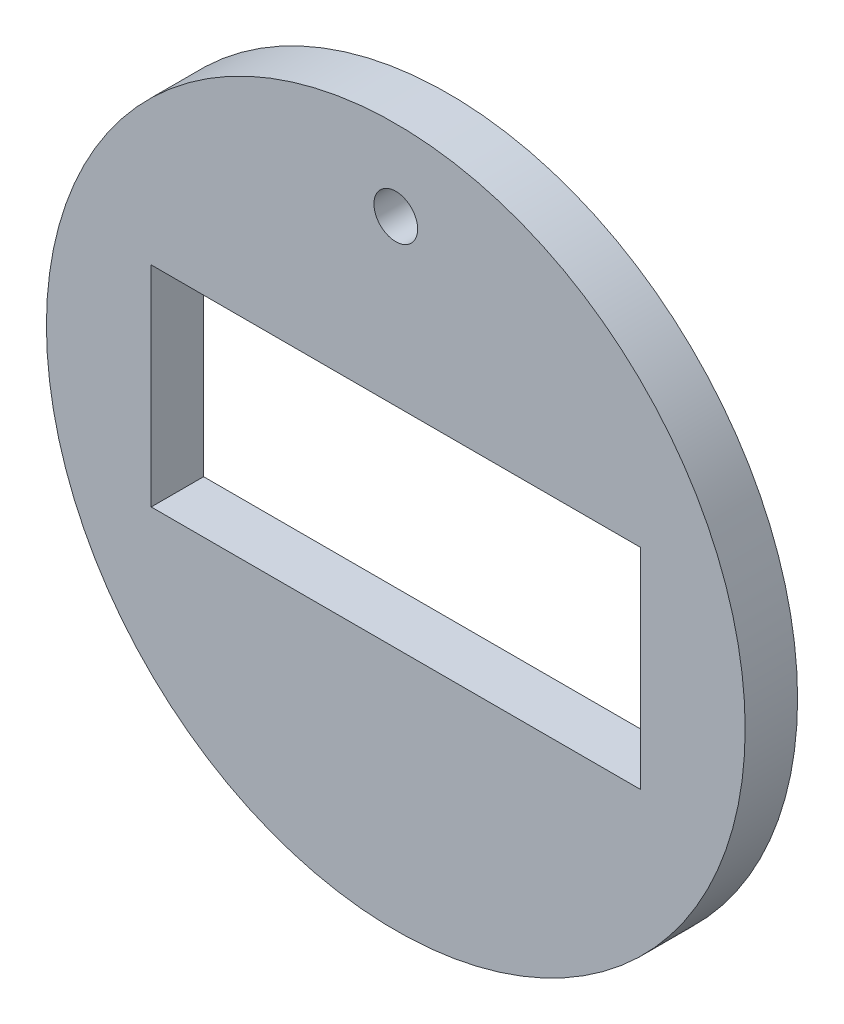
ISO-10303-21;
HEADER;
FILE_DESCRIPTION(('STEP AP214'),'2;1');
FILE_NAME('part.step','',(''),(''),'','','');
FILE_SCHEMA(('AUTOMOTIVE_DESIGN { 1 0 10303 214 1 1 1 1 }'));
ENDSEC;
DATA;
#1=APPLICATION_CONTEXT('core data for automotive mechanical design processes');
#2=APPLICATION_PROTOCOL_DEFINITION('international standard','automotive_design',2000,#1);
#3=PRODUCT_CONTEXT('',#1,'mechanical');
#4=PRODUCT('Part','Part','',(#3));
#5=PRODUCT_RELATED_PRODUCT_CATEGORY('part','',(#4));
#6=PRODUCT_DEFINITION_FORMATION('','',#4);
#7=PRODUCT_DEFINITION_CONTEXT('part definition',#1,'design');
#8=PRODUCT_DEFINITION('design','',#6,#7);
#9=PRODUCT_DEFINITION_SHAPE('','',#8);
#10=(LENGTH_UNIT() NAMED_UNIT(*) SI_UNIT(.MILLI.,.METRE.));
#11=(NAMED_UNIT(*) PLANE_ANGLE_UNIT() SI_UNIT($,.RADIAN.));
#12=(NAMED_UNIT(*) SI_UNIT($,.STERADIAN.) SOLID_ANGLE_UNIT());
#13=UNCERTAINTY_MEASURE_WITH_UNIT(LENGTH_MEASURE(1.E-05),#10,'distance_accuracy_value','');
#14=(GEOMETRIC_REPRESENTATION_CONTEXT(3) GLOBAL_UNCERTAINTY_ASSIGNED_CONTEXT((#13)) GLOBAL_UNIT_ASSIGNED_CONTEXT((#10,
#11,#12)) REPRESENTATION_CONTEXT('',''));
#15=CARTESIAN_POINT('',(0.,0.,0.));
#16=DIRECTION('',(0.,0.,1.));
#17=DIRECTION('',(1.,0.,0.));
#18=AXIS2_PLACEMENT_3D('',#15,#16,#17);
#19=CARTESIAN_POINT('',(0.,0.,3.81));
#20=DIRECTION('',(0.,0.,1.));
#21=DIRECTION('',(1.,0.,0.));
#22=AXIS2_PLACEMENT_3D('',#19,#20,#21);
#23=PLANE('',#22);
#24=CARTESIAN_POINT('',(0.,0.,3.81));
#25=DIRECTION('',(0.,0.,1.));
#26=DIRECTION('',(1.,0.,0.));
#27=AXIS2_PLACEMENT_3D('',#24,#25,#26);
#28=CIRCLE('',#27,25.4);
#29=CARTESIAN_POINT('',(-25.4,0.,3.81));
#30=VERTEX_POINT('',#29);
#31=EDGE_CURVE('E11',#30,#30,#28,.T.);
#32=ORIENTED_EDGE('',*,*,#31,.T.);
#33=EDGE_LOOP('',(#32));
#34=FACE_BOUND('',#33,.T.);
#35=DIRECTION('',(0.,-1.,0.));
#36=VECTOR('',#35,1.);
#37=CARTESIAN_POINT('',(-17.78,7.62,3.81));
#38=LINE('',#37,#36);
#39=CARTESIAN_POINT('',(-17.78,7.62,3.81));
#40=VERTEX_POINT('',#39);
#41=CARTESIAN_POINT('',(-17.78,-7.62,3.81));
#42=VERTEX_POINT('',#41);
#43=EDGE_CURVE('E46',#40,#42,#38,.T.);
#44=ORIENTED_EDGE('',*,*,#43,.F.);
#45=DIRECTION('',(-1.,0.,0.));
#46=VECTOR('',#45,1.);
#47=CARTESIAN_POINT('',(-17.78,7.62,3.81));
#48=LINE('',#47,#46);
#49=CARTESIAN_POINT('',(17.78,7.62,3.81));
#50=VERTEX_POINT('',#49);
#51=EDGE_CURVE('E89',#50,#40,#48,.T.);
#52=ORIENTED_EDGE('',*,*,#51,.F.);
#53=DIRECTION('',(0.,1.,0.));
#54=VECTOR('',#53,1.);
#55=CARTESIAN_POINT('',(17.78,7.62,3.81));
#56=LINE('',#55,#54);
#57=CARTESIAN_POINT('',(17.78,-7.62,3.81));
#58=VERTEX_POINT('',#57);
#59=EDGE_CURVE('E74',#58,#50,#56,.T.);
#60=ORIENTED_EDGE('',*,*,#59,.F.);
#61=DIRECTION('',(1.,0.,0.));
#62=VECTOR('',#61,1.);
#63=CARTESIAN_POINT('',(-17.78,-7.62,3.81));
#64=LINE('',#63,#62);
#65=EDGE_CURVE('E83',#42,#58,#64,.T.);
#66=ORIENTED_EDGE('',*,*,#65,.F.);
#67=EDGE_LOOP('',(#44,#52,#60,#66));
#68=FACE_BOUND('',#67,.T.);
#69=CARTESIAN_POINT('',(0.,19.558,3.81));
#70=DIRECTION('',(0.,0.,1.));
#71=DIRECTION('',(1.,0.,0.));
#72=AXIS2_PLACEMENT_3D('',#69,#70,#71);
#73=CIRCLE('',#72,1.5875);
#74=CARTESIAN_POINT('',(-1.5875,19.558,3.81));
#75=VERTEX_POINT('',#74);
#76=EDGE_CURVE('E120',#75,#75,#73,.T.);
#77=ORIENTED_EDGE('',*,*,#76,.F.);
#78=EDGE_LOOP('',(#77));
#79=FACE_BOUND('',#78,.T.);
#80=ADVANCED_FACE('F31',(#34,#68,#79),#23,.T.);
#81=CARTESIAN_POINT('',(0.,0.,0.));
#82=DIRECTION('',(0.,0.,1.));
#83=DIRECTION('',(1.,0.,0.));
#84=AXIS2_PLACEMENT_3D('',#81,#82,#83);
#85=PLANE('',#84);
#86=CARTESIAN_POINT('',(0.,0.,0.));
#87=DIRECTION('',(0.,0.,1.));
#88=DIRECTION('',(1.,0.,0.));
#89=AXIS2_PLACEMENT_3D('',#86,#87,#88);
#90=CIRCLE('',#89,25.4);
#91=CARTESIAN_POINT('',(-25.4,0.,0.));
#92=VERTEX_POINT('',#91);
#93=EDGE_CURVE('E39',#92,#92,#90,.T.);
#94=ORIENTED_EDGE('',*,*,#93,.F.);
#95=EDGE_LOOP('',(#94));
#96=FACE_BOUND('',#95,.T.);
#97=DIRECTION('',(-1.,0.,0.));
#98=VECTOR('',#97,1.);
#99=CARTESIAN_POINT('',(-17.78,7.62,0.));
#100=LINE('',#99,#98);
#101=CARTESIAN_POINT('',(17.78,7.62,0.));
#102=VERTEX_POINT('',#101);
#103=CARTESIAN_POINT('',(-17.78,7.62,0.));
#104=VERTEX_POINT('',#103);
#105=EDGE_CURVE('E100',#102,#104,#100,.T.);
#106=ORIENTED_EDGE('',*,*,#105,.T.);
#107=DIRECTION('',(0.,-1.,0.));
#108=VECTOR('',#107,1.);
#109=CARTESIAN_POINT('',(-17.78,7.62,0.));
#110=LINE('',#109,#108);
#111=CARTESIAN_POINT('',(-17.78,-7.62,0.));
#112=VERTEX_POINT('',#111);
#113=EDGE_CURVE('E91',#104,#112,#110,.T.);
#114=ORIENTED_EDGE('',*,*,#113,.T.);
#115=DIRECTION('',(1.,0.,0.));
#116=VECTOR('',#115,1.);
#117=CARTESIAN_POINT('',(-17.78,-7.62,0.));
#118=LINE('',#117,#116);
#119=CARTESIAN_POINT('',(17.78,-7.62,0.));
#120=VERTEX_POINT('',#119);
#121=EDGE_CURVE('E97',#112,#120,#118,.T.);
#122=ORIENTED_EDGE('',*,*,#121,.T.);
#123=DIRECTION('',(0.,1.,0.));
#124=VECTOR('',#123,1.);
#125=CARTESIAN_POINT('',(17.78,7.62,0.));
#126=LINE('',#125,#124);
#127=EDGE_CURVE('E54',#120,#102,#126,.T.);
#128=ORIENTED_EDGE('',*,*,#127,.T.);
#129=EDGE_LOOP('',(#106,#114,#122,#128));
#130=FACE_BOUND('',#129,.T.);
#131=CARTESIAN_POINT('',(0.,19.558,0.));
#132=DIRECTION('',(0.,0.,1.));
#133=DIRECTION('',(1.,0.,0.));
#134=AXIS2_PLACEMENT_3D('',#131,#132,#133);
#135=CIRCLE('',#134,1.5875);
#136=CARTESIAN_POINT('',(-1.5875,19.558,0.));
#137=VERTEX_POINT('',#136);
#138=EDGE_CURVE('E118',#137,#137,#135,.T.);
#139=ORIENTED_EDGE('',*,*,#138,.T.);
#140=EDGE_LOOP('',(#139));
#141=FACE_BOUND('',#140,.T.);
#142=ADVANCED_FACE('F110',(#96,#130,#141),#85,.F.);
#143=CARTESIAN_POINT('',(0.,0.,3.81));
#144=DIRECTION('',(0.,0.,-1.));
#145=DIRECTION('',(-1.,0.,0.));
#146=AXIS2_PLACEMENT_3D('',#143,#144,#145);
#147=CYLINDRICAL_SURFACE('',#146,25.4);
#148=CARTESIAN_POINT('',(-25.4,0.,3.81));
#149=CARTESIAN_POINT('',(-25.4,0.,3.7703125));
#150=CARTESIAN_POINT('',(-25.4,0.,3.730625));
#151=CARTESIAN_POINT('',(-25.4,0.,3.65125));
#152=CARTESIAN_POINT('',(-25.4,0.,3.6115625));
#153=CARTESIAN_POINT('',(-25.4,0.,3.5321875));
#154=CARTESIAN_POINT('',(-25.4,0.,3.4925));
#155=CARTESIAN_POINT('',(-25.4,0.,3.413125));
#156=CARTESIAN_POINT('',(-25.4,0.,3.3734375));
#157=CARTESIAN_POINT('',(-25.4,0.,3.2940625));
#158=CARTESIAN_POINT('',(-25.4,0.,3.254375));
#159=CARTESIAN_POINT('',(-25.4,0.,3.175));
#160=CARTESIAN_POINT('',(-25.4,0.,3.1353125));
#161=CARTESIAN_POINT('',(-25.4,0.,3.0559375));
#162=CARTESIAN_POINT('',(-25.4,0.,3.01625));
#163=CARTESIAN_POINT('',(-25.4,0.,2.936875));
#164=CARTESIAN_POINT('',(-25.4,0.,2.8971875));
#165=CARTESIAN_POINT('',(-25.4,0.,2.8178125));
#166=CARTESIAN_POINT('',(-25.4,0.,2.778125));
#167=CARTESIAN_POINT('',(-25.4,0.,2.69875));
#168=CARTESIAN_POINT('',(-25.4,0.,2.6590625));
#169=CARTESIAN_POINT('',(-25.4,0.,2.5796875));
#170=CARTESIAN_POINT('',(-25.4,0.,2.54));
#171=CARTESIAN_POINT('',(-25.4,0.,2.460625));
#172=CARTESIAN_POINT('',(-25.4,0.,2.4209375));
#173=CARTESIAN_POINT('',(-25.4,0.,2.3415625));
#174=CARTESIAN_POINT('',(-25.4,0.,2.301875));
#175=CARTESIAN_POINT('',(-25.4,0.,2.2225));
#176=CARTESIAN_POINT('',(-25.4,0.,2.1828125));
#177=CARTESIAN_POINT('',(-25.4,0.,2.1034375));
#178=CARTESIAN_POINT('',(-25.4,0.,2.06375));
#179=CARTESIAN_POINT('',(-25.4,0.,1.984375));
#180=CARTESIAN_POINT('',(-25.4,0.,1.9446875));
#181=CARTESIAN_POINT('',(-25.4,0.,1.8653125));
#182=CARTESIAN_POINT('',(-25.4,0.,1.825625));
#183=CARTESIAN_POINT('',(-25.4,0.,1.74625));
#184=CARTESIAN_POINT('',(-25.4,0.,1.7065625));
#185=CARTESIAN_POINT('',(-25.4,0.,1.6271875));
#186=CARTESIAN_POINT('',(-25.4,0.,1.5875));
#187=CARTESIAN_POINT('',(-25.4,0.,1.508125));
#188=CARTESIAN_POINT('',(-25.4,0.,1.4684375));
#189=CARTESIAN_POINT('',(-25.4,0.,1.3890625));
#190=CARTESIAN_POINT('',(-25.4,0.,1.349375));
#191=CARTESIAN_POINT('',(-25.4,0.,1.27));
#192=CARTESIAN_POINT('',(-25.4,0.,1.2303125));
#193=CARTESIAN_POINT('',(-25.4,0.,1.1509375));
#194=CARTESIAN_POINT('',(-25.4,0.,1.11125));
#195=CARTESIAN_POINT('',(-25.4,0.,1.031875));
#196=CARTESIAN_POINT('',(-25.4,0.,0.9921875));
#197=CARTESIAN_POINT('',(-25.4,0.,0.9128125));
#198=CARTESIAN_POINT('',(-25.4,0.,0.873125));
#199=CARTESIAN_POINT('',(-25.4,0.,0.79375));
#200=CARTESIAN_POINT('',(-25.4,0.,0.7540625));
#201=CARTESIAN_POINT('',(-25.4,0.,0.6746875));
#202=CARTESIAN_POINT('',(-25.4,0.,0.635));
#203=CARTESIAN_POINT('',(-25.4,0.,0.555625));
#204=CARTESIAN_POINT('',(-25.4,0.,0.5159375));
#205=CARTESIAN_POINT('',(-25.4,0.,0.4365625));
#206=CARTESIAN_POINT('',(-25.4,0.,0.396875));
#207=CARTESIAN_POINT('',(-25.4,0.,0.3175));
#208=CARTESIAN_POINT('',(-25.4,0.,0.2778125));
#209=CARTESIAN_POINT('',(-25.4,0.,0.1984375));
#210=CARTESIAN_POINT('',(-25.4,0.,0.15875));
#211=CARTESIAN_POINT('',(-25.4,0.,0.0793749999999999));
#212=CARTESIAN_POINT('',(-25.4,0.,0.0396874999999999));
#213=CARTESIAN_POINT('',(-25.4,0.,0.));
#214=B_SPLINE_CURVE_WITH_KNOTS('',3,(#148,#149,#150,#151,#152,#153,#154,#155,#156,#157,#158,
#159,#160,#161,#162,#163,#164,#165,#166,#167,#168,#169,#170,#171,#172,#173,#174,#175,#176,#177,
#178,#179,#180,#181,#182,#183,#184,#185,#186,#187,#188,#189,#190,#191,#192,#193,#194,#195,#196,
#197,#198,#199,#200,#201,#202,#203,#204,#205,#206,#207,#208,#209,#210,#211,#212,#213),
.UNSPECIFIED.,.F.,.F.,(4,2,2,2,2,2,2,2,2,2,2,2,2,2,2,2,2,2,2,2,2,2,2,2,2,2,2,2,2,2,2,2,4),(0.,
0.1190625,0.238125,0.3571875,0.47625,0.595312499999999,0.714375,0.833437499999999,
0.952499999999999,1.0715625,1.190625,1.3096875,1.42875,1.5478125,1.666875,1.7859375,1.905,
2.0240625,2.143125,2.2621875,2.38125,2.5003125,2.619375,2.7384375,2.8575,2.9765625,3.095625,
3.2146875,3.33375,3.4528125,3.571875,3.6909375,3.81),.UNSPECIFIED.);
#215=EDGE_CURVE('BSEAM33',#30,#92,#214,.T.);
#216=ORIENTED_EDGE('',*,*,#31,.F.);
#217=ORIENTED_EDGE('',*,*,#93,.T.);
#218=ORIENTED_EDGE('',*,*,#215,.T.);
#219=ORIENTED_EDGE('',*,*,#215,.F.);
#220=EDGE_LOOP('',(#216,#218,#217,#219));
#221=FACE_BOUND('',#220,.T.);
#222=ADVANCED_FACE('F33',(#221),#147,.T.);
#223=CARTESIAN_POINT('',(-17.78,7.62,0.));
#224=DIRECTION('',(-1.,0.,0.));
#225=DIRECTION('',(0.,-1.,0.));
#226=AXIS2_PLACEMENT_3D('',#223,#224,#225);
#227=PLANE('',#226);
#228=ORIENTED_EDGE('',*,*,#43,.T.);
#229=DIRECTION('',(0.,0.,1.));
#230=VECTOR('',#229,1.);
#231=CARTESIAN_POINT('',(-17.78,-7.62,0.));
#232=LINE('',#231,#230);
#233=EDGE_CURVE('E80',#112,#42,#232,.T.);
#234=ORIENTED_EDGE('',*,*,#233,.F.);
#235=ORIENTED_EDGE('',*,*,#113,.F.);
#236=DIRECTION('',(0.,0.,1.));
#237=VECTOR('',#236,1.);
#238=CARTESIAN_POINT('',(-17.78,7.62,0.));
#239=LINE('',#238,#237);
#240=EDGE_CURVE('E103',#104,#40,#239,.T.);
#241=ORIENTED_EDGE('',*,*,#240,.T.);
#242=EDGE_LOOP('',(#228,#234,#235,#241));
#243=FACE_BOUND('',#242,.T.);
#244=ADVANCED_FACE('F132',(#243),#227,.F.);
#245=CARTESIAN_POINT('',(-17.78,7.62,0.));
#246=DIRECTION('',(0.,1.,0.));
#247=DIRECTION('',(0.,0.,1.));
#248=AXIS2_PLACEMENT_3D('',#245,#246,#247);
#249=PLANE('',#248);
#250=ORIENTED_EDGE('',*,*,#51,.T.);
#251=ORIENTED_EDGE('',*,*,#240,.F.);
#252=ORIENTED_EDGE('',*,*,#105,.F.);
#253=DIRECTION('',(0.,0.,1.));
#254=VECTOR('',#253,1.);
#255=CARTESIAN_POINT('',(17.78,7.62,0.));
#256=LINE('',#255,#254);
#257=EDGE_CURVE('E79',#102,#50,#256,.T.);
#258=ORIENTED_EDGE('',*,*,#257,.T.);
#259=EDGE_LOOP('',(#250,#251,#252,#258));
#260=FACE_BOUND('',#259,.T.);
#261=ADVANCED_FACE('F135',(#260),#249,.F.);
#262=CARTESIAN_POINT('',(17.78,7.62,0.));
#263=DIRECTION('',(1.,0.,0.));
#264=DIRECTION('',(0.,1.,0.));
#265=AXIS2_PLACEMENT_3D('',#262,#263,#264);
#266=PLANE('',#265);
#267=ORIENTED_EDGE('',*,*,#59,.T.);
#268=ORIENTED_EDGE('',*,*,#257,.F.);
#269=ORIENTED_EDGE('',*,*,#127,.F.);
#270=DIRECTION('',(0.,0.,1.));
#271=VECTOR('',#270,1.);
#272=CARTESIAN_POINT('',(17.78,-7.62,0.));
#273=LINE('',#272,#271);
#274=EDGE_CURVE('E70',#120,#58,#273,.T.);
#275=ORIENTED_EDGE('',*,*,#274,.T.);
#276=EDGE_LOOP('',(#267,#268,#269,#275));
#277=FACE_BOUND('',#276,.T.);
#278=ADVANCED_FACE('F72',(#277),#266,.F.);
#279=CARTESIAN_POINT('',(-17.78,-7.62,0.));
#280=DIRECTION('',(0.,-1.,0.));
#281=DIRECTION('',(0.,0.,-1.));
#282=AXIS2_PLACEMENT_3D('',#279,#280,#281);
#283=PLANE('',#282);
#284=ORIENTED_EDGE('',*,*,#65,.T.);
#285=ORIENTED_EDGE('',*,*,#274,.F.);
#286=ORIENTED_EDGE('',*,*,#121,.F.);
#287=ORIENTED_EDGE('',*,*,#233,.T.);
#288=EDGE_LOOP('',(#284,#285,#286,#287));
#289=FACE_BOUND('',#288,.T.);
#290=ADVANCED_FACE('F84',(#289),#283,.F.);
#291=CARTESIAN_POINT('',(0.,19.558,3.81));
#292=DIRECTION('',(0.,0.,-1.));
#293=DIRECTION('',(-1.,0.,0.));
#294=AXIS2_PLACEMENT_3D('',#291,#292,#293);
#295=CYLINDRICAL_SURFACE('',#294,1.5875);
#296=CARTESIAN_POINT('',(-1.5875,19.558,3.81));
#297=CARTESIAN_POINT('',(-1.5875,19.558,3.7703125));
#298=CARTESIAN_POINT('',(-1.5875,19.558,3.730625));
#299=CARTESIAN_POINT('',(-1.5875,19.558,3.65125));
#300=CARTESIAN_POINT('',(-1.5875,19.558,3.6115625));
#301=CARTESIAN_POINT('',(-1.5875,19.558,3.5321875));
#302=CARTESIAN_POINT('',(-1.5875,19.558,3.4925));
#303=CARTESIAN_POINT('',(-1.5875,19.558,3.413125));
#304=CARTESIAN_POINT('',(-1.5875,19.558,3.3734375));
#305=CARTESIAN_POINT('',(-1.5875,19.558,3.2940625));
#306=CARTESIAN_POINT('',(-1.5875,19.558,3.254375));
#307=CARTESIAN_POINT('',(-1.5875,19.558,3.175));
#308=CARTESIAN_POINT('',(-1.5875,19.558,3.1353125));
#309=CARTESIAN_POINT('',(-1.5875,19.558,3.0559375));
#310=CARTESIAN_POINT('',(-1.5875,19.558,3.01625));
#311=CARTESIAN_POINT('',(-1.5875,19.558,2.936875));
#312=CARTESIAN_POINT('',(-1.5875,19.558,2.8971875));
#313=CARTESIAN_POINT('',(-1.5875,19.558,2.8178125));
#314=CARTESIAN_POINT('',(-1.5875,19.558,2.778125));
#315=CARTESIAN_POINT('',(-1.5875,19.558,2.69875));
#316=CARTESIAN_POINT('',(-1.5875,19.558,2.6590625));
#317=CARTESIAN_POINT('',(-1.5875,19.558,2.5796875));
#318=CARTESIAN_POINT('',(-1.5875,19.558,2.54));
#319=CARTESIAN_POINT('',(-1.5875,19.558,2.460625));
#320=CARTESIAN_POINT('',(-1.5875,19.558,2.4209375));
#321=CARTESIAN_POINT('',(-1.5875,19.558,2.3415625));
#322=CARTESIAN_POINT('',(-1.5875,19.558,2.301875));
#323=CARTESIAN_POINT('',(-1.5875,19.558,2.2225));
#324=CARTESIAN_POINT('',(-1.5875,19.558,2.1828125));
#325=CARTESIAN_POINT('',(-1.5875,19.558,2.1034375));
#326=CARTESIAN_POINT('',(-1.5875,19.558,2.06375));
#327=CARTESIAN_POINT('',(-1.5875,19.558,1.984375));
#328=CARTESIAN_POINT('',(-1.5875,19.558,1.9446875));
#329=CARTESIAN_POINT('',(-1.5875,19.558,1.8653125));
#330=CARTESIAN_POINT('',(-1.5875,19.558,1.825625));
#331=CARTESIAN_POINT('',(-1.5875,19.558,1.74625));
#332=CARTESIAN_POINT('',(-1.5875,19.558,1.7065625));
#333=CARTESIAN_POINT('',(-1.5875,19.558,1.6271875));
#334=CARTESIAN_POINT('',(-1.5875,19.558,1.5875));
#335=CARTESIAN_POINT('',(-1.5875,19.558,1.508125));
#336=CARTESIAN_POINT('',(-1.5875,19.558,1.4684375));
#337=CARTESIAN_POINT('',(-1.5875,19.558,1.3890625));
#338=CARTESIAN_POINT('',(-1.5875,19.558,1.349375));
#339=CARTESIAN_POINT('',(-1.5875,19.558,1.27));
#340=CARTESIAN_POINT('',(-1.5875,19.558,1.2303125));
#341=CARTESIAN_POINT('',(-1.5875,19.558,1.1509375));
#342=CARTESIAN_POINT('',(-1.5875,19.558,1.11125));
#343=CARTESIAN_POINT('',(-1.5875,19.558,1.031875));
#344=CARTESIAN_POINT('',(-1.5875,19.558,0.9921875));
#345=CARTESIAN_POINT('',(-1.5875,19.558,0.9128125));
#346=CARTESIAN_POINT('',(-1.5875,19.558,0.873125));
#347=CARTESIAN_POINT('',(-1.5875,19.558,0.79375));
#348=CARTESIAN_POINT('',(-1.5875,19.558,0.7540625));
#349=CARTESIAN_POINT('',(-1.5875,19.558,0.6746875));
#350=CARTESIAN_POINT('',(-1.5875,19.558,0.635));
#351=CARTESIAN_POINT('',(-1.5875,19.558,0.555625));
#352=CARTESIAN_POINT('',(-1.5875,19.558,0.5159375));
#353=CARTESIAN_POINT('',(-1.5875,19.558,0.4365625));
#354=CARTESIAN_POINT('',(-1.5875,19.558,0.396875));
#355=CARTESIAN_POINT('',(-1.5875,19.558,0.3175));
#356=CARTESIAN_POINT('',(-1.5875,19.558,0.2778125));
#357=CARTESIAN_POINT('',(-1.5875,19.558,0.1984375));
#358=CARTESIAN_POINT('',(-1.5875,19.558,0.15875));
#359=CARTESIAN_POINT('',(-1.5875,19.558,0.0793749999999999));
#360=CARTESIAN_POINT('',(-1.5875,19.558,0.0396874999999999));
#361=CARTESIAN_POINT('',(-1.5875,19.558,0.));
#362=B_SPLINE_CURVE_WITH_KNOTS('',3,(#296,#297,#298,#299,#300,#301,#302,#303,#304,#305,#306,
#307,#308,#309,#310,#311,#312,#313,#314,#315,#316,#317,#318,#319,#320,#321,#322,#323,#324,#325,
#326,#327,#328,#329,#330,#331,#332,#333,#334,#335,#336,#337,#338,#339,#340,#341,#342,#343,#344,
#345,#346,#347,#348,#349,#350,#351,#352,#353,#354,#355,#356,#357,#358,#359,#360,#361),
.UNSPECIFIED.,.F.,.F.,(4,2,2,2,2,2,2,2,2,2,2,2,2,2,2,2,2,2,2,2,2,2,2,2,2,2,2,2,2,2,2,2,4),(0.,
0.1190625,0.238125,0.3571875,0.47625,0.5953125,0.714375,0.8334375,0.9525,1.0715625,1.190625,
1.3096875,1.42875,1.5478125,1.666875,1.7859375,1.905,2.0240625,2.143125,2.2621875,2.38125,
2.5003125,2.619375,2.7384375,2.8575,2.9765625,3.095625,3.2146875,3.33375,3.4528125,3.571875,
3.6909375,3.81),.UNSPECIFIED.);
#363=EDGE_CURVE('BSEAM126',#75,#137,#362,.T.);
#364=ORIENTED_EDGE('',*,*,#76,.T.);
#365=ORIENTED_EDGE('',*,*,#138,.F.);
#366=ORIENTED_EDGE('',*,*,#363,.T.);
#367=ORIENTED_EDGE('',*,*,#363,.F.);
#368=EDGE_LOOP('',(#364,#366,#365,#367));
#369=FACE_BOUND('',#368,.T.);
#370=ADVANCED_FACE('F126',(#369),#295,.F.);
#371=CLOSED_SHELL('',(#80,#142,#222,#244,#261,#278,#290,#370));
#372=MANIFOLD_SOLID_BREP('B2',#371);
#373=ADVANCED_BREP_SHAPE_REPRESENTATION('',(#18,#372),#14);
#374=SHAPE_DEFINITION_REPRESENTATION(#9,#373);
ENDSEC;
END-ISO-10303-21;
